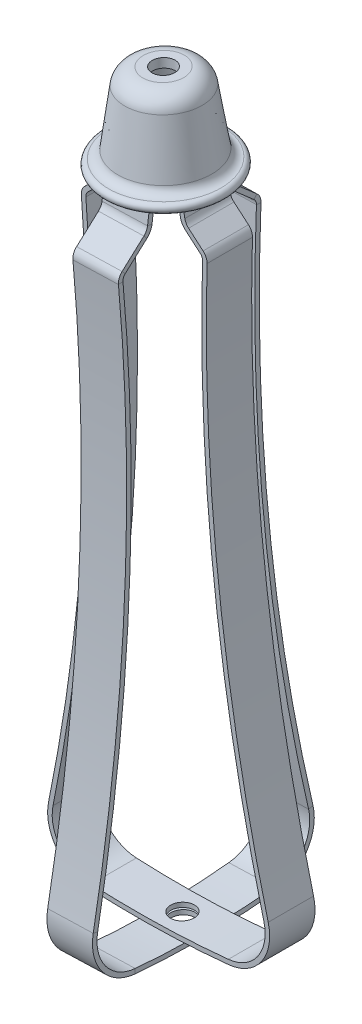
from build123d import *

# Parameters (mm, degrees)
SKETCH3_W          = 0.635
SKETCH3_H          = 6.35
SKETCH6_W          = 6.35
SKETCH6_H          = 0.635
SKETCH7_R          = 1.651
CUT_EXTRUDE1_DEPTH = 18.288


with BuildPart() as part:
    # Sketch1 → Revolve1 (revolve)
    with BuildSketch(Plane.XY, mode=Mode.PRIVATE) as revolve1_sk:
        with BuildLine():
            Line((10.855516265, -6.719431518), (12.108821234, -6.686612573))
            ThreePointArc((12.108821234, -6.686612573), (13.781713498, -7.258238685), (14.676421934, -8.782975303))
            Line((14.676421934, -8.782975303), (16.029977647, -16.428970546))
            ThreePointArc((16.029977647, -16.428970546), (16.477331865, -17.191338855), (17.313777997, -17.477151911))
            Line((17.313777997, -17.477151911), (17.31493332, -17.477121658))
            ThreePointArc((17.31493332, -17.477121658), (17.966333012, -18.095089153), (17.348563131, -18.74667626))
            ThreePointArc((17.348563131, -18.74667626), (15.674727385, -18.175578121), (14.779422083, -16.650354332))
            Line((14.779422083, -16.650354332), (13.425866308, -9.00435874))
            ThreePointArc((13.425866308, -9.00435874), (12.97851209, -8.241990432), (12.142065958, -7.956177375))
            Line((12.142065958, -7.956177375), (10.88876099, -7.988996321))
            Line((10.88876099, -7.988996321), (10.855516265, -6.719431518))
        make_face()
    revolve(revolve1_sk.sketch.rotate(Axis((8.786124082, 11.940002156, 0), (0.02617694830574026, -0.9996573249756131, 0)), 180), axis=Axis((8.786124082, 11.940002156, 0), (0.02617694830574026, -0.9996573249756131, 0)))

    # Sweep1: sweep along a path in Sketch2
    with BuildLine(Plane.XY) as sweep1_path:
        Line((14.18028002, -13.770972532), (15.431190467, -20.520281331))
        ThreePointArc((15.431190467, -20.520281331), (15.61665553, -21.023628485), (15.95917201, -21.436469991))
        Line((15.95917201, -21.436469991), (17.988769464, -23.175553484))
        ThreePointArc((17.988769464, -23.175553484), (18.407178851, -23.737803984), (18.542713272, -24.425424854))
        ThreePointArc((18.542713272, -24.425424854), (20.159197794, -62.518073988), (27.103335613, -100.007297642))
        ThreePointArc((27.103335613, -100.007297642), (26.167239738, -105.228886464), (21.594418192, -107.917858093))
        ThreePointArc((21.594418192, -107.917858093), (11.940765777, -108.530903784), (2.268259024, -108.423931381))
        ThreePointArc((2.268259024, -108.423931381), (-2.43902553, -105.977967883), (-3.647115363, -100.81252654))
        ThreePointArc((-3.647115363, -100.81252654), (1.325471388, -63.011252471), (0.946125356, -24.886207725))
        ThreePointArc((0.946125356, -24.886207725), (1.045486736, -24.192435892), (1.43389679, -23.609058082))
        Line((1.43389679, -23.609058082), (3.369696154, -21.766137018))
        ThreePointArc((3.369696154, -21.766137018), (3.690136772, -21.33593537), (3.849004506, -20.823571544))
        Line((3.849004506, -20.823571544), (4.744969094, -14.018044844))
    # Sketch3 → Sweep1 (sweep)
    with BuildSketch(Plane(origin=(14.18028002, -13.770972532, 0), x_dir=(0.9832549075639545, 0.18223552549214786, 0), z_dir=(0.18223552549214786, -0.9832549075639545, 0))):
        with Locations((-0.3175, 0)):
            Rectangle(SKETCH3_W, SKETCH3_H)
    sweep(path=sweep1_path.line)

    # Sweep2: sweep along a path in Sketch5
    with BuildLine(Plane(origin=(9.632051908, -20.364678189, 0), x_dir=(2.3944351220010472e-05, -0.0009143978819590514, -0.9999995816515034), z_dir=(0.9996573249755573, 0.02617694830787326, 0))) as sweep2_path:
        Line((4.698803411, 5.587888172), (5.774695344, -1.123406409))
        ThreePointArc((5.774695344, -1.123406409), (5.955170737, -1.644363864), (6.302940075, -2.072177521))
        Line((6.302940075, -2.072177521), (9.423837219, -4.77485604))
        ThreePointArc((9.423837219, -4.77485604), (9.849761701, -5.36380982), (9.968556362, -6.080863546))
        ThreePointArc((9.968556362, -6.080863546), (10.066833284, -43.684216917), (15.367095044, -80.912285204))
        ThreePointArc((15.367095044, -80.912285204), (14.290472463, -85.979734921), (9.797536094, -88.558821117))
        ThreePointArc((9.797536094, -88.558821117), (0.015837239, -89.08824832), (-9.772478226, -88.699910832))
        ThreePointArc((-9.772478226, -88.699910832), (-14.330406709, -86.147915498), (-15.432543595, -81.041773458))
        ThreePointArc((-15.432543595, -81.041773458), (-10.109309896, -43.750258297), (-10.006260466, -6.080863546))
        ThreePointArc((-10.006260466, -6.080863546), (-9.887465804, -5.36380982), (-9.461541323, -4.77485604))
        Line((-9.461541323, -4.77485604), (-6.340644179, -2.072177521))
        ThreePointArc((-6.340644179, -2.072177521), (-5.992874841, -1.644363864), (-5.812399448, -1.123406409))
        Line((-5.812399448, -1.123406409), (-4.736507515, 5.587888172))
    # Sketch6 → Sweep2 (sweep)
    with BuildSketch(Plane(origin=(9.485664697, -14.774376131, 4.731394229), x_dir=(-0.9996660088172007, -0.025522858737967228, 0.004056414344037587), z_dir=(-0.025843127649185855, 0.9869092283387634, -0.15919267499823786))):
        with Locations((0, -0.3175)):
            Rectangle(SKETCH6_W, SKETCH6_H)
    sweep(path=sweep2_path.line)

    # Sketch7 → Cut-Extrude1 (cut)
    with BuildSketch(Plane(origin=(12.265329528, -120.925493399, 0), x_dir=(0.9996573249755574, 0.02617694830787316, 0), z_dir=(0.026176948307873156, -0.9996573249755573, 0))):
        with Locations(Location((0, 0, 0), (0, 0, 223.082229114))):
            Circle(SKETCH7_R)
    extrude(amount=-CUT_EXTRUDE1_DEPTH, mode=Mode.SUBTRACT)


solid = part.part
